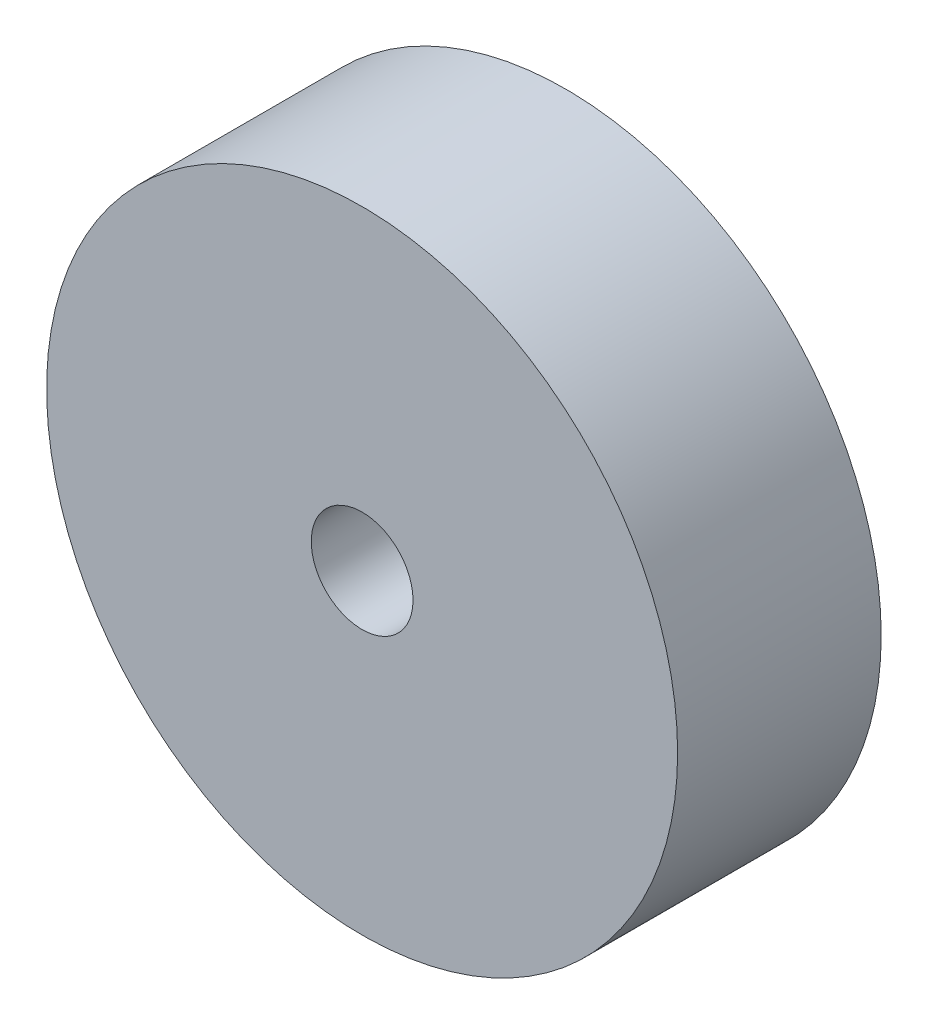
ISO-10303-21;
HEADER;
FILE_DESCRIPTION(('STEP AP214'),'2;1');
FILE_NAME('part.step','',(''),(''),'','','');
FILE_SCHEMA(('AUTOMOTIVE_DESIGN { 1 0 10303 214 1 1 1 1 }'));
ENDSEC;
DATA;
#1=APPLICATION_CONTEXT('core data for automotive mechanical design processes');
#2=APPLICATION_PROTOCOL_DEFINITION('international standard','automotive_design',2000,#1);
#3=PRODUCT_CONTEXT('',#1,'mechanical');
#4=PRODUCT('Part','Part','',(#3));
#5=PRODUCT_RELATED_PRODUCT_CATEGORY('part','',(#4));
#6=PRODUCT_DEFINITION_FORMATION('','',#4);
#7=PRODUCT_DEFINITION_CONTEXT('part definition',#1,'design');
#8=PRODUCT_DEFINITION('design','',#6,#7);
#9=PRODUCT_DEFINITION_SHAPE('','',#8);
#10=(LENGTH_UNIT() NAMED_UNIT(*) SI_UNIT(.MILLI.,.METRE.));
#11=(NAMED_UNIT(*) PLANE_ANGLE_UNIT() SI_UNIT($,.RADIAN.));
#12=(NAMED_UNIT(*) SI_UNIT($,.STERADIAN.) SOLID_ANGLE_UNIT());
#13=UNCERTAINTY_MEASURE_WITH_UNIT(LENGTH_MEASURE(1.E-05),#10,'distance_accuracy_value','');
#14=(GEOMETRIC_REPRESENTATION_CONTEXT(3) GLOBAL_UNCERTAINTY_ASSIGNED_CONTEXT((#13)) GLOBAL_UNIT_ASSIGNED_CONTEXT((#10,
#11,#12)) REPRESENTATION_CONTEXT('',''));
#15=CARTESIAN_POINT('',(0.,0.,0.));
#16=DIRECTION('',(0.,0.,1.));
#17=DIRECTION('',(1.,0.,0.));
#18=AXIS2_PLACEMENT_3D('',#15,#16,#17);
#19=CARTESIAN_POINT('',(0.,0.,2.));
#20=DIRECTION('',(0.,0.,-1.));
#21=DIRECTION('',(-1.,0.,0.));
#22=AXIS2_PLACEMENT_3D('',#19,#20,#21);
#23=CYLINDRICAL_SURFACE('',#22,6.2);
#24=CARTESIAN_POINT('',(0.,0.,2.));
#25=DIRECTION('',(0.,0.,1.));
#26=DIRECTION('',(1.,0.,0.));
#27=AXIS2_PLACEMENT_3D('',#24,#25,#26);
#28=CIRCLE('',#27,6.2);
#29=CARTESIAN_POINT('',(6.2,0.,2.));
#30=VERTEX_POINT('',#29);
#31=EDGE_CURVE('E10',#30,#30,#28,.T.);
#32=ORIENTED_EDGE('',*,*,#31,.F.);
#33=EDGE_LOOP('',(#32));
#34=FACE_BOUND('',#33,.T.);
#35=CARTESIAN_POINT('',(0.,0.,-2.));
#36=DIRECTION('',(0.,0.,1.));
#37=DIRECTION('',(1.,0.,0.));
#38=AXIS2_PLACEMENT_3D('',#35,#36,#37);
#39=CIRCLE('',#38,6.2);
#40=CARTESIAN_POINT('',(6.2,0.,-2.));
#41=VERTEX_POINT('',#40);
#42=EDGE_CURVE('E33',#41,#41,#39,.T.);
#43=ORIENTED_EDGE('',*,*,#42,.T.);
#44=EDGE_LOOP('',(#43));
#45=FACE_BOUND('',#44,.T.);
#46=ADVANCED_FACE('F30',(#34,#45),#23,.T.);
#47=CARTESIAN_POINT('',(0.,0.,2.));
#48=DIRECTION('',(0.,0.,1.));
#49=DIRECTION('',(1.,0.,0.));
#50=AXIS2_PLACEMENT_3D('',#47,#48,#49);
#51=PLANE('',#50);
#52=CARTESIAN_POINT('',(0.,0.,2.));
#53=DIRECTION('',(0.,0.,1.));
#54=DIRECTION('',(1.,0.,0.));
#55=AXIS2_PLACEMENT_3D('',#52,#53,#54);
#56=CIRCLE('',#55,1.);
#57=CARTESIAN_POINT('',(1.,0.,2.));
#58=VERTEX_POINT('',#57);
#59=EDGE_CURVE('E44',#58,#58,#56,.T.);
#60=ORIENTED_EDGE('',*,*,#59,.F.);
#61=EDGE_LOOP('',(#60));
#62=FACE_BOUND('',#61,.T.);
#63=ORIENTED_EDGE('',*,*,#31,.T.);
#64=EDGE_LOOP('',(#63));
#65=FACE_BOUND('',#64,.T.);
#66=ADVANCED_FACE('F50',(#62,#65),#51,.T.);
#67=CARTESIAN_POINT('',(0.,0.,-2.));
#68=DIRECTION('',(0.,0.,1.));
#69=DIRECTION('',(1.,0.,0.));
#70=AXIS2_PLACEMENT_3D('',#67,#68,#69);
#71=PLANE('',#70);
#72=CARTESIAN_POINT('',(0.,0.,-2.));
#73=DIRECTION('',(0.,0.,1.));
#74=DIRECTION('',(1.,0.,0.));
#75=AXIS2_PLACEMENT_3D('',#72,#73,#74);
#76=CIRCLE('',#75,1.);
#77=CARTESIAN_POINT('',(1.,0.,-2.));
#78=VERTEX_POINT('',#77);
#79=EDGE_CURVE('E40',#78,#78,#76,.T.);
#80=ORIENTED_EDGE('',*,*,#79,.T.);
#81=EDGE_LOOP('',(#80));
#82=FACE_BOUND('',#81,.T.);
#83=ORIENTED_EDGE('',*,*,#42,.F.);
#84=EDGE_LOOP('',(#83));
#85=FACE_BOUND('',#84,.T.);
#86=ADVANCED_FACE('F52',(#82,#85),#71,.F.);
#87=CARTESIAN_POINT('',(0.,0.,-2.));
#88=DIRECTION('',(0.,0.,1.));
#89=DIRECTION('',(1.,0.,0.));
#90=AXIS2_PLACEMENT_3D('',#87,#88,#89);
#91=CYLINDRICAL_SURFACE('',#90,1.);
#92=ORIENTED_EDGE('',*,*,#79,.F.);
#93=EDGE_LOOP('',(#92));
#94=FACE_BOUND('',#93,.T.);
#95=ORIENTED_EDGE('',*,*,#59,.T.);
#96=EDGE_LOOP('',(#95));
#97=FACE_BOUND('',#96,.T.);
#98=ADVANCED_FACE('F48',(#94,#97),#91,.F.);
#99=CLOSED_SHELL('',(#46,#66,#86,#98));
#100=MANIFOLD_SOLID_BREP('B2',#99);
#101=ADVANCED_BREP_SHAPE_REPRESENTATION('',(#18,#100),#14);
#102=SHAPE_DEFINITION_REPRESENTATION(#9,#101);
ENDSEC;
END-ISO-10303-21;
